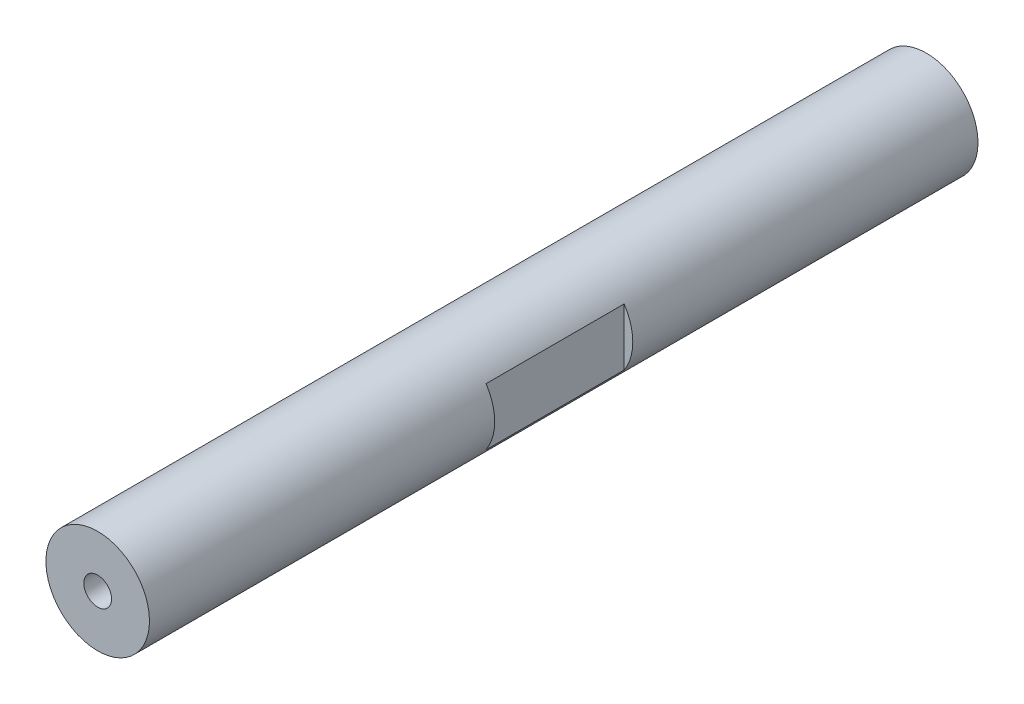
from build123d import *

# Parameters (mm, degrees)
SKETCH1_R               = 9.525
BOSS_EXTRUDE1_DEPTH     = 76.2
CUT_EXTRUDE1_DEPTH      = 78.381465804
CUT_EXTRUDE1_DEPTH_BACK = 78.381465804
SKETCH5_W               = 1.5875
SKETCH5_H               = 25.4


with BuildPart() as part:
    # Sketch1 → Boss-Extrude1 (new, symmetric)
    with BuildSketch(Plane.XY):
        Circle(SKETCH1_R)
    extrude(amount=BOSS_EXTRUDE1_DEPTH, both=True)

    # Sketch4 → 1_4-20 Tapped Hole1 (revolve, cut)
    with BuildSketch(Plane(origin=(0, 0, 76.2), x_dir=(0, -1, 0), z_dir=(1, 0, 0))):
        Polygon((0, 0), (0, 33.283816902), (2.5527, 31.75), (2.5527, 0), align=None)
    f_1_4_20_tapped_hole1 = revolve(axis=Axis((0, 0, 82.55), (0, 0, -1)), mode=Mode.SUBTRACT)

    # Mirror1: 1_4-20 Tapped Hole1 across plane
    add(f_1_4_20_tapped_hole1.mirror(Plane.XY), mode=Mode.SUBTRACT)

    # Sketch5 → Cut-Extrude1 (cut, two sides: drawn at the far end of the back side and taken through both)
    with BuildSketch(Plane(origin=(0, 0, 0), x_dir=(1, 0, 0), z_dir=(0, 1, 0)).offset(-CUT_EXTRUDE1_DEPTH_BACK)):
        with Locations((-8.73125, 0)):
            Rectangle(SKETCH5_W, SKETCH5_H)
        with Locations((8.73125, 0)):
            Rectangle(SKETCH5_W, SKETCH5_H)
    extrude(amount=CUT_EXTRUDE1_DEPTH + CUT_EXTRUDE1_DEPTH_BACK, mode=Mode.SUBTRACT)


solid = part.part
